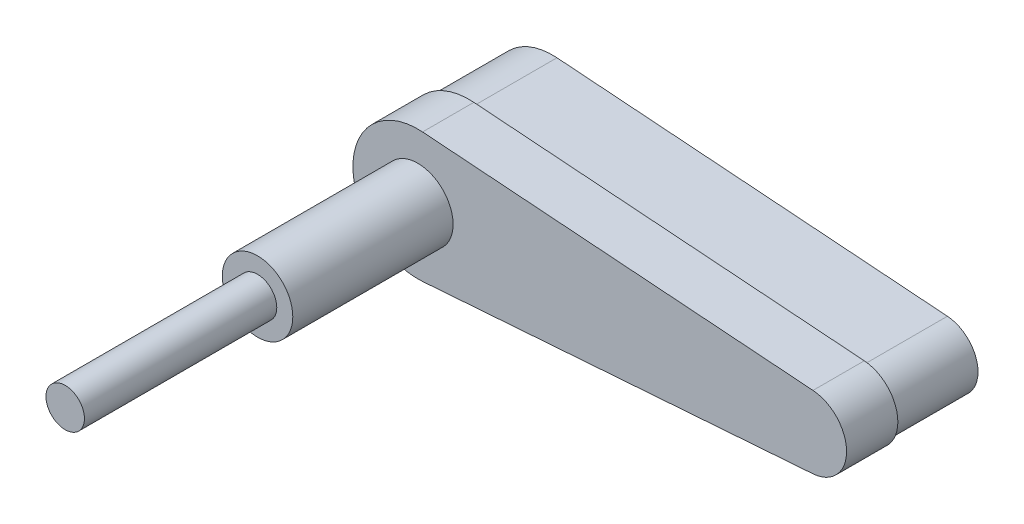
ISO-10303-21;
HEADER;
FILE_DESCRIPTION(('STEP AP214'),'2;1');
FILE_NAME('part.step','',(''),(''),'','','');
FILE_SCHEMA(('AUTOMOTIVE_DESIGN { 1 0 10303 214 1 1 1 1 }'));
ENDSEC;
DATA;
#1=APPLICATION_CONTEXT('core data for automotive mechanical design processes');
#2=APPLICATION_PROTOCOL_DEFINITION('international standard','automotive_design',2000,#1);
#3=PRODUCT_CONTEXT('',#1,'mechanical');
#4=PRODUCT('Part','Part','',(#3));
#5=PRODUCT_RELATED_PRODUCT_CATEGORY('part','',(#4));
#6=PRODUCT_DEFINITION_FORMATION('','',#4);
#7=PRODUCT_DEFINITION_CONTEXT('part definition',#1,'design');
#8=PRODUCT_DEFINITION('design','',#6,#7);
#9=PRODUCT_DEFINITION_SHAPE('','',#8);
#10=(LENGTH_UNIT() NAMED_UNIT(*) SI_UNIT(.MILLI.,.METRE.));
#11=(NAMED_UNIT(*) PLANE_ANGLE_UNIT() SI_UNIT($,.RADIAN.));
#12=(NAMED_UNIT(*) SI_UNIT($,.STERADIAN.) SOLID_ANGLE_UNIT());
#13=UNCERTAINTY_MEASURE_WITH_UNIT(LENGTH_MEASURE(1.E-05),#10,'distance_accuracy_value','');
#14=(GEOMETRIC_REPRESENTATION_CONTEXT(3) GLOBAL_UNCERTAINTY_ASSIGNED_CONTEXT((#13)) GLOBAL_UNIT_ASSIGNED_CONTEXT((#10,
#11,#12)) REPRESENTATION_CONTEXT('',''));
#15=CARTESIAN_POINT('',(0.,0.,0.));
#16=DIRECTION('',(0.,0.,1.));
#17=DIRECTION('',(1.,0.,0.));
#18=AXIS2_PLACEMENT_3D('',#15,#16,#17);
#19=CARTESIAN_POINT('',(9.62576122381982,0.,76.));
#20=DIRECTION('',(0.,0.,-1.));
#21=DIRECTION('',(-1.,0.,0.));
#22=AXIS2_PLACEMENT_3D('',#19,#20,#21);
#23=CYLINDRICAL_SURFACE('',#22,5.5);
#24=CARTESIAN_POINT('',(9.62576122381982,0.,21.));
#25=DIRECTION('',(0.,0.,1.));
#26=DIRECTION('',(1.,0.,0.));
#27=AXIS2_PLACEMENT_3D('',#24,#25,#26);
#28=CIRCLE('',#27,5.5);
#29=CARTESIAN_POINT('',(15.1257612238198,0.,21.));
#30=VERTEX_POINT('',#29);
#31=EDGE_CURVE('E214',#30,#30,#28,.T.);
#32=ORIENTED_EDGE('',*,*,#31,.T.);
#33=EDGE_LOOP('',(#32));
#34=FACE_BOUND('',#33,.T.);
#35=CARTESIAN_POINT('',(9.62576122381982,0.,46.));
#36=DIRECTION('',(0.,0.,1.));
#37=DIRECTION('',(1.,0.,0.));
#38=AXIS2_PLACEMENT_3D('',#35,#36,#37);
#39=CIRCLE('',#38,5.5);
#40=CARTESIAN_POINT('',(15.1257612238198,0.,46.));
#41=VERTEX_POINT('',#40);
#42=EDGE_CURVE('E209',#41,#41,#39,.T.);
#43=ORIENTED_EDGE('',*,*,#42,.F.);
#44=EDGE_LOOP('',(#43));
#45=FACE_BOUND('',#44,.T.);
#46=ADVANCED_FACE('F33',(#34,#45),#23,.T.);
#47=CARTESIAN_POINT('',(70.8505161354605,0.,21.));
#48=DIRECTION('',(0.,0.,1.));
#49=DIRECTION('',(1.,0.,0.));
#50=AXIS2_PLACEMENT_3D('',#47,#48,#49);
#51=PLANE('',#50);
#52=CARTESIAN_POINT('',(70.8505161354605,0.,21.));
#53=DIRECTION('',(0.,0.,1.));
#54=DIRECTION('',(1.,0.,0.));
#55=AXIS2_PLACEMENT_3D('',#52,#53,#54);
#56=CIRCLE('',#55,5.64948386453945);
#57=CARTESIAN_POINT('',(71.2635624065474,-5.63436426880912,21.));
#58=VERTEX_POINT('',#57);
#59=CARTESIAN_POINT('',(71.2635624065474,5.63436426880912,21.));
#60=VERTEX_POINT('',#59);
#61=EDGE_CURVE('E118',#58,#60,#56,.T.);
#62=ORIENTED_EDGE('',*,*,#61,.T.);
#63=DIRECTION('',(-0.997323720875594,0.0731122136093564,0.));
#64=VECTOR('',#63,1.);
#65=CARTESIAN_POINT('',(71.2635624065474,5.63436426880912,21.));
#66=LINE('',#65,#64);
#67=CARTESIAN_POINT('',(10.3660780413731,10.0986618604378,21.));
#68=VERTEX_POINT('',#67);
#69=EDGE_CURVE('E107',#60,#68,#66,.T.);
#70=ORIENTED_EDGE('',*,*,#69,.T.);
#71=CARTESIAN_POINT('',(9.62576122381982,0.,21.));
#72=DIRECTION('',(0.,0.,1.));
#73=DIRECTION('',(1.,0.,0.));
#74=AXIS2_PLACEMENT_3D('',#71,#72,#73);
#75=CIRCLE('',#74,10.1257612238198);
#76=CARTESIAN_POINT('',(10.3660780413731,-10.0986618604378,21.));
#77=VERTEX_POINT('',#76);
#78=EDGE_CURVE('E117',#68,#77,#75,.T.);
#79=ORIENTED_EDGE('',*,*,#78,.T.);
#80=DIRECTION('',(0.997323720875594,0.0731122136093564,0.));
#81=VECTOR('',#80,1.);
#82=CARTESIAN_POINT('',(10.3660780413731,-10.0986618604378,21.));
#83=LINE('',#82,#81);
#84=EDGE_CURVE('E124',#77,#58,#83,.T.);
#85=ORIENTED_EDGE('',*,*,#84,.T.);
#86=EDGE_LOOP('',(#62,#70,#79,#85));
#87=FACE_BOUND('',#86,.T.);
#88=ORIENTED_EDGE('',*,*,#31,.F.);
#89=EDGE_LOOP('',(#88));
#90=FACE_BOUND('',#89,.T.);
#91=ADVANCED_FACE('F121',(#87,#90),#51,.T.);
#92=CARTESIAN_POINT('',(9.62576122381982,0.,13.));
#93=DIRECTION('',(0.,0.,-1.));
#94=DIRECTION('',(-1.,0.,0.));
#95=AXIS2_PLACEMENT_3D('',#92,#93,#94);
#96=CYLINDRICAL_SURFACE('',#95,9.62576122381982);
#97=CARTESIAN_POINT('',(9.62576122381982,0.,0.));
#98=DIRECTION('',(0.,0.,1.));
#99=DIRECTION('',(1.,0.,0.));
#100=AXIS2_PLACEMENT_3D('',#97,#98,#99);
#101=CIRCLE('',#100,9.62576122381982);
#102=CARTESIAN_POINT('',(10.3295219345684,9.6,0.));
#103=VERTEX_POINT('',#102);
#104=CARTESIAN_POINT('',(10.3295219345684,-9.6,0.));
#105=VERTEX_POINT('',#104);
#106=EDGE_CURVE('E133',#103,#105,#101,.T.);
#107=ORIENTED_EDGE('',*,*,#106,.T.);
#108=DIRECTION('',(0.,0.,-1.));
#109=VECTOR('',#108,1.);
#110=CARTESIAN_POINT('',(10.3295219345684,-9.6,13.));
#111=LINE('',#110,#109);
#112=CARTESIAN_POINT('',(10.3295219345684,-9.6,13.));
#113=VERTEX_POINT('',#112);
#114=EDGE_CURVE('E11',#113,#105,#111,.T.);
#115=ORIENTED_EDGE('',*,*,#114,.F.);
#116=CARTESIAN_POINT('',(9.62576122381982,0.,13.));
#117=DIRECTION('',(0.,0.,1.));
#118=DIRECTION('',(1.,0.,0.));
#119=AXIS2_PLACEMENT_3D('',#116,#117,#118);
#120=CIRCLE('',#119,9.62576122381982);
#121=CARTESIAN_POINT('',(10.3295219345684,9.6,13.));
#122=VERTEX_POINT('',#121);
#123=EDGE_CURVE('E142',#122,#113,#120,.T.);
#124=ORIENTED_EDGE('',*,*,#123,.F.);
#125=DIRECTION('',(0.,0.,-1.));
#126=VECTOR('',#125,1.);
#127=CARTESIAN_POINT('',(10.3295219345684,9.6,13.));
#128=LINE('',#127,#126);
#129=EDGE_CURVE('E151',#122,#103,#128,.T.);
#130=ORIENTED_EDGE('',*,*,#129,.T.);
#131=EDGE_LOOP('',(#107,#115,#124,#130));
#132=FACE_BOUND('',#131,.T.);
#133=ADVANCED_FACE('F35',(#132),#96,.T.);
#134=CARTESIAN_POINT('',(10.3295219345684,-9.6,13.));
#135=DIRECTION('',(-0.0731122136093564,0.997323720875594,0.));
#136=DIRECTION('',(-0.997323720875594,-0.0731122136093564,0.));
#137=AXIS2_PLACEMENT_3D('',#134,#135,#136);
#138=PLANE('',#137);
#139=DIRECTION('',(0.997323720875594,0.0731122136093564,0.));
#140=VECTOR('',#139,1.);
#141=CARTESIAN_POINT('',(10.3295219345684,-9.6,0.));
#142=LINE('',#141,#140);
#143=CARTESIAN_POINT('',(71.2270062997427,-5.13570240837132,0.));
#144=VERTEX_POINT('',#143);
#145=EDGE_CURVE('E136',#105,#144,#142,.T.);
#146=ORIENTED_EDGE('',*,*,#145,.T.);
#147=DIRECTION('',(0.,0.,-1.));
#148=VECTOR('',#147,1.);
#149=CARTESIAN_POINT('',(71.2270062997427,-5.13570240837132,13.));
#150=LINE('',#149,#148);
#151=CARTESIAN_POINT('',(71.2270062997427,-5.13570240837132,13.));
#152=VERTEX_POINT('',#151);
#153=EDGE_CURVE('E42',#152,#144,#150,.T.);
#154=ORIENTED_EDGE('',*,*,#153,.F.);
#155=DIRECTION('',(0.997323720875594,0.0731122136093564,0.));
#156=VECTOR('',#155,1.);
#157=CARTESIAN_POINT('',(10.3295219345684,-9.6,13.));
#158=LINE('',#157,#156);
#159=EDGE_CURVE('E76',#113,#152,#158,.T.);
#160=ORIENTED_EDGE('',*,*,#159,.F.);
#161=ORIENTED_EDGE('',*,*,#114,.T.);
#162=EDGE_LOOP('',(#146,#154,#160,#161));
#163=FACE_BOUND('',#162,.T.);
#164=ADVANCED_FACE('F243',(#163),#138,.F.);
#165=CARTESIAN_POINT('',(70.8505161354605,0.,13.));
#166=DIRECTION('',(0.,0.,-1.));
#167=DIRECTION('',(-1.,0.,0.));
#168=AXIS2_PLACEMENT_3D('',#165,#166,#167);
#169=CYLINDRICAL_SURFACE('',#168,5.14948386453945);
#170=CARTESIAN_POINT('',(70.8505161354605,0.,0.));
#171=DIRECTION('',(0.,0.,1.));
#172=DIRECTION('',(-1.,0.,0.));
#173=AXIS2_PLACEMENT_3D('',#170,#171,#172);
#174=CIRCLE('',#173,5.14948386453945);
#175=CARTESIAN_POINT('',(71.2270062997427,5.13570240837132,0.));
#176=VERTEX_POINT('',#175);
#177=EDGE_CURVE('E66',#144,#176,#174,.T.);
#178=ORIENTED_EDGE('',*,*,#177,.T.);
#179=DIRECTION('',(0.,0.,-1.));
#180=VECTOR('',#179,1.);
#181=CARTESIAN_POINT('',(71.2270062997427,5.13570240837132,13.));
#182=LINE('',#181,#180);
#183=CARTESIAN_POINT('',(71.2270062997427,5.13570240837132,13.));
#184=VERTEX_POINT('',#183);
#185=EDGE_CURVE('E50',#184,#176,#182,.T.);
#186=ORIENTED_EDGE('',*,*,#185,.F.);
#187=CARTESIAN_POINT('',(70.8505161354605,0.,13.));
#188=DIRECTION('',(0.,0.,1.));
#189=DIRECTION('',(-1.,0.,0.));
#190=AXIS2_PLACEMENT_3D('',#187,#188,#189);
#191=CIRCLE('',#190,5.14948386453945);
#192=EDGE_CURVE('E146',#152,#184,#191,.T.);
#193=ORIENTED_EDGE('',*,*,#192,.F.);
#194=ORIENTED_EDGE('',*,*,#153,.T.);
#195=EDGE_LOOP('',(#178,#186,#193,#194));
#196=FACE_BOUND('',#195,.T.);
#197=ADVANCED_FACE('F157',(#196),#169,.T.);
#198=CARTESIAN_POINT('',(10.3295219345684,9.6,13.));
#199=DIRECTION('',(-0.0731122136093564,-0.997323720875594,0.));
#200=DIRECTION('',(0.997323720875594,-0.0731122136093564,0.));
#201=AXIS2_PLACEMENT_3D('',#198,#199,#200);
#202=PLANE('',#201);
#203=DIRECTION('',(-0.997323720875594,0.0731122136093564,0.));
#204=VECTOR('',#203,1.);
#205=CARTESIAN_POINT('',(10.3295219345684,9.6,0.));
#206=LINE('',#205,#204);
#207=EDGE_CURVE('E71',#176,#103,#206,.T.);
#208=ORIENTED_EDGE('',*,*,#207,.T.);
#209=ORIENTED_EDGE('',*,*,#129,.F.);
#210=DIRECTION('',(-0.997323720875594,0.0731122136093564,0.));
#211=VECTOR('',#210,1.);
#212=CARTESIAN_POINT('',(10.3295219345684,9.6,13.));
#213=LINE('',#212,#211);
#214=EDGE_CURVE('E149',#184,#122,#213,.T.);
#215=ORIENTED_EDGE('',*,*,#214,.F.);
#216=ORIENTED_EDGE('',*,*,#185,.T.);
#217=EDGE_LOOP('',(#208,#209,#215,#216));
#218=FACE_BOUND('',#217,.T.);
#219=ADVANCED_FACE('F162',(#218),#202,.F.);
#220=CARTESIAN_POINT('',(9.62576122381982,0.,0.));
#221=DIRECTION('',(0.,0.,1.));
#222=DIRECTION('',(1.,0.,0.));
#223=AXIS2_PLACEMENT_3D('',#220,#221,#222);
#224=PLANE('',#223);
#225=ORIENTED_EDGE('',*,*,#106,.F.);
#226=ORIENTED_EDGE('',*,*,#207,.F.);
#227=ORIENTED_EDGE('',*,*,#177,.F.);
#228=ORIENTED_EDGE('',*,*,#145,.F.);
#229=EDGE_LOOP('',(#225,#226,#227,#228));
#230=FACE_BOUND('',#229,.T.);
#231=ADVANCED_FACE('F160',(#230),#224,.F.);
#232=CARTESIAN_POINT('',(70.8505161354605,0.,13.));
#233=DIRECTION('',(0.,0.,1.));
#234=DIRECTION('',(1.,0.,0.));
#235=AXIS2_PLACEMENT_3D('',#232,#233,#234);
#236=PLANE('',#235);
#237=CARTESIAN_POINT('',(70.8505161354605,0.,13.));
#238=DIRECTION('',(0.,0.,1.));
#239=DIRECTION('',(1.,0.,0.));
#240=AXIS2_PLACEMENT_3D('',#237,#238,#239);
#241=CIRCLE('',#240,5.64948386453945);
#242=CARTESIAN_POINT('',(71.2635624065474,-5.63436426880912,13.));
#243=VERTEX_POINT('',#242);
#244=CARTESIAN_POINT('',(71.2635624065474,5.63436426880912,13.));
#245=VERTEX_POINT('',#244);
#246=EDGE_CURVE('E132',#243,#245,#241,.T.);
#247=ORIENTED_EDGE('',*,*,#246,.F.);
#248=DIRECTION('',(0.997323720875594,0.0731122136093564,0.));
#249=VECTOR('',#248,1.);
#250=CARTESIAN_POINT('',(10.3660780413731,-10.0986618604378,13.));
#251=LINE('',#250,#249);
#252=CARTESIAN_POINT('',(10.3660780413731,-10.0986618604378,13.));
#253=VERTEX_POINT('',#252);
#254=EDGE_CURVE('E128',#253,#243,#251,.T.);
#255=ORIENTED_EDGE('',*,*,#254,.F.);
#256=CARTESIAN_POINT('',(9.62576122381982,0.,13.));
#257=DIRECTION('',(0.,0.,1.));
#258=DIRECTION('',(1.,0.,0.));
#259=AXIS2_PLACEMENT_3D('',#256,#257,#258);
#260=CIRCLE('',#259,10.1257612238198);
#261=CARTESIAN_POINT('',(10.3660780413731,10.0986618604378,13.));
#262=VERTEX_POINT('',#261);
#263=EDGE_CURVE('E222',#262,#253,#260,.T.);
#264=ORIENTED_EDGE('',*,*,#263,.F.);
#265=DIRECTION('',(-0.997323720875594,0.0731122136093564,0.));
#266=VECTOR('',#265,1.);
#267=CARTESIAN_POINT('',(71.2635624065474,5.63436426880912,13.));
#268=LINE('',#267,#266);
#269=EDGE_CURVE('E220',#245,#262,#268,.T.);
#270=ORIENTED_EDGE('',*,*,#269,.F.);
#271=EDGE_LOOP('',(#247,#255,#264,#270));
#272=FACE_BOUND('',#271,.T.);
#273=ORIENTED_EDGE('',*,*,#214,.T.);
#274=ORIENTED_EDGE('',*,*,#123,.T.);
#275=ORIENTED_EDGE('',*,*,#159,.T.);
#276=ORIENTED_EDGE('',*,*,#192,.T.);
#277=EDGE_LOOP('',(#273,#274,#275,#276));
#278=FACE_BOUND('',#277,.T.);
#279=ADVANCED_FACE('F164',(#272,#278),#236,.F.);
#280=CARTESIAN_POINT('',(70.8505161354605,0.,21.));
#281=DIRECTION('',(0.,0.,-1.));
#282=DIRECTION('',(-1.,0.,0.));
#283=AXIS2_PLACEMENT_3D('',#280,#281,#282);
#284=CYLINDRICAL_SURFACE('',#283,5.64948386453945);
#285=ORIENTED_EDGE('',*,*,#246,.T.);
#286=DIRECTION('',(0.,0.,-1.));
#287=VECTOR('',#286,1.);
#288=CARTESIAN_POINT('',(71.2635624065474,5.63436426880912,21.));
#289=LINE('',#288,#287);
#290=EDGE_CURVE('E111',#60,#245,#289,.T.);
#291=ORIENTED_EDGE('',*,*,#290,.F.);
#292=ORIENTED_EDGE('',*,*,#61,.F.);
#293=DIRECTION('',(0.,0.,-1.));
#294=VECTOR('',#293,1.);
#295=CARTESIAN_POINT('',(71.2635624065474,-5.63436426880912,21.));
#296=LINE('',#295,#294);
#297=EDGE_CURVE('E218',#58,#243,#296,.T.);
#298=ORIENTED_EDGE('',*,*,#297,.T.);
#299=EDGE_LOOP('',(#285,#291,#292,#298));
#300=FACE_BOUND('',#299,.T.);
#301=ADVANCED_FACE('F130',(#300),#284,.T.);
#302=CARTESIAN_POINT('',(71.2635624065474,5.63436426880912,21.));
#303=DIRECTION('',(-0.0731122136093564,-0.997323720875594,0.));
#304=DIRECTION('',(0.997323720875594,-0.0731122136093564,0.));
#305=AXIS2_PLACEMENT_3D('',#302,#303,#304);
#306=PLANE('',#305);
#307=ORIENTED_EDGE('',*,*,#269,.T.);
#308=DIRECTION('',(0.,0.,-1.));
#309=VECTOR('',#308,1.);
#310=CARTESIAN_POINT('',(10.3660780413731,10.0986618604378,21.));
#311=LINE('',#310,#309);
#312=EDGE_CURVE('E114',#68,#262,#311,.T.);
#313=ORIENTED_EDGE('',*,*,#312,.F.);
#314=ORIENTED_EDGE('',*,*,#69,.F.);
#315=ORIENTED_EDGE('',*,*,#290,.T.);
#316=EDGE_LOOP('',(#307,#313,#314,#315));
#317=FACE_BOUND('',#316,.T.);
#318=ADVANCED_FACE('F109',(#317),#306,.F.);
#319=CARTESIAN_POINT('',(9.62576122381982,0.,21.));
#320=DIRECTION('',(0.,0.,-1.));
#321=DIRECTION('',(-1.,0.,0.));
#322=AXIS2_PLACEMENT_3D('',#319,#320,#321);
#323=CYLINDRICAL_SURFACE('',#322,10.1257612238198);
#324=ORIENTED_EDGE('',*,*,#263,.T.);
#325=DIRECTION('',(0.,0.,-1.));
#326=VECTOR('',#325,1.);
#327=CARTESIAN_POINT('',(10.3660780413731,-10.0986618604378,21.));
#328=LINE('',#327,#326);
#329=EDGE_CURVE('E138',#77,#253,#328,.T.);
#330=ORIENTED_EDGE('',*,*,#329,.F.);
#331=ORIENTED_EDGE('',*,*,#78,.F.);
#332=ORIENTED_EDGE('',*,*,#312,.T.);
#333=EDGE_LOOP('',(#324,#330,#331,#332));
#334=FACE_BOUND('',#333,.T.);
#335=ADVANCED_FACE('F231',(#334),#323,.T.);
#336=CARTESIAN_POINT('',(10.3660780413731,-10.0986618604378,21.));
#337=DIRECTION('',(-0.0731122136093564,0.997323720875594,0.));
#338=DIRECTION('',(-0.997323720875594,-0.0731122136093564,0.));
#339=AXIS2_PLACEMENT_3D('',#336,#337,#338);
#340=PLANE('',#339);
#341=ORIENTED_EDGE('',*,*,#254,.T.);
#342=ORIENTED_EDGE('',*,*,#297,.F.);
#343=ORIENTED_EDGE('',*,*,#84,.F.);
#344=ORIENTED_EDGE('',*,*,#329,.T.);
#345=EDGE_LOOP('',(#341,#342,#343,#344));
#346=FACE_BOUND('',#345,.T.);
#347=ADVANCED_FACE('F195',(#346),#340,.F.);
#348=CARTESIAN_POINT('',(9.62576122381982,0.,46.));
#349=DIRECTION('',(0.,0.,1.));
#350=DIRECTION('',(1.,0.,0.));
#351=AXIS2_PLACEMENT_3D('',#348,#349,#350);
#352=PLANE('',#351);
#353=CARTESIAN_POINT('',(9.62576122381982,0.,46.));
#354=DIRECTION('',(0.,0.,1.));
#355=DIRECTION('',(1.,0.,0.));
#356=AXIS2_PLACEMENT_3D('',#353,#354,#355);
#357=CIRCLE('',#356,3.);
#358=CARTESIAN_POINT('',(12.6257612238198,0.,46.));
#359=VERTEX_POINT('',#358);
#360=EDGE_CURVE('E204',#359,#359,#357,.T.);
#361=ORIENTED_EDGE('',*,*,#360,.F.);
#362=EDGE_LOOP('',(#361));
#363=FACE_BOUND('',#362,.T.);
#364=ORIENTED_EDGE('',*,*,#42,.T.);
#365=EDGE_LOOP('',(#364));
#366=FACE_BOUND('',#365,.T.);
#367=ADVANCED_FACE('F192',(#363,#366),#352,.T.);
#368=CARTESIAN_POINT('',(9.62576122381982,0.,46.));
#369=DIRECTION('',(0.,0.,1.));
#370=DIRECTION('',(1.,0.,0.));
#371=AXIS2_PLACEMENT_3D('',#368,#369,#370);
#372=CYLINDRICAL_SURFACE('',#371,3.);
#373=ORIENTED_EDGE('',*,*,#360,.T.);
#374=EDGE_LOOP('',(#373));
#375=FACE_BOUND('',#374,.T.);
#376=CARTESIAN_POINT('',(9.62576122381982,0.,76.));
#377=DIRECTION('',(0.,0.,1.));
#378=DIRECTION('',(1.,0.,0.));
#379=AXIS2_PLACEMENT_3D('',#376,#377,#378);
#380=CIRCLE('',#379,3.);
#381=CARTESIAN_POINT('',(12.6257612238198,0.,76.));
#382=VERTEX_POINT('',#381);
#383=EDGE_CURVE('E207',#382,#382,#380,.T.);
#384=ORIENTED_EDGE('',*,*,#383,.F.);
#385=EDGE_LOOP('',(#384));
#386=FACE_BOUND('',#385,.T.);
#387=ADVANCED_FACE('F190',(#375,#386),#372,.T.);
#388=CARTESIAN_POINT('',(9.62576122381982,0.,76.));
#389=DIRECTION('',(0.,0.,1.));
#390=DIRECTION('',(1.,0.,0.));
#391=AXIS2_PLACEMENT_3D('',#388,#389,#390);
#392=PLANE('',#391);
#393=ORIENTED_EDGE('',*,*,#383,.T.);
#394=EDGE_LOOP('',(#393));
#395=FACE_BOUND('',#394,.T.);
#396=ADVANCED_FACE('F187',(#395),#392,.T.);
#397=CLOSED_SHELL('',(#46,#91,#133,#164,#197,#219,#231,#279,#301,#318,#335,#347,#367,#387,#396));
#398=MANIFOLD_SOLID_BREP('B2',#397);
#399=ADVANCED_BREP_SHAPE_REPRESENTATION('',(#18,#398),#14);
#400=SHAPE_DEFINITION_REPRESENTATION(#9,#399);
ENDSEC;
END-ISO-10303-21;
